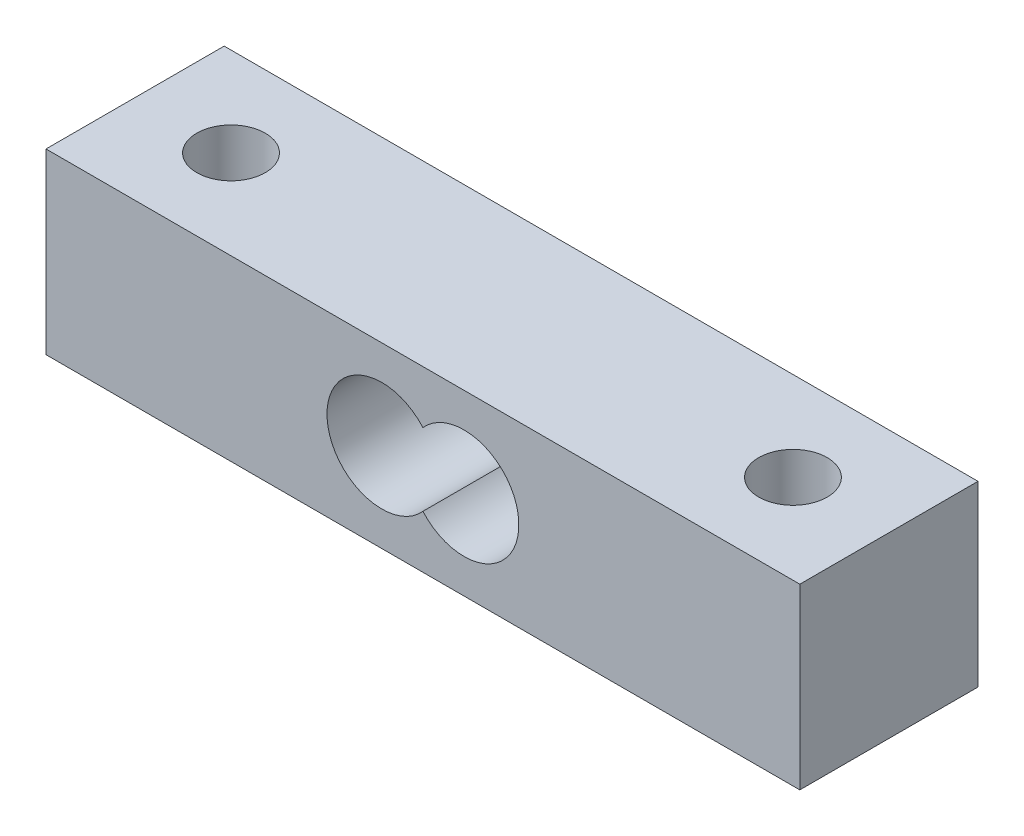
ISO-10303-21;
HEADER;
FILE_DESCRIPTION(('STEP AP214'),'2;1');
FILE_NAME('part.step','',(''),(''),'','','');
FILE_SCHEMA(('AUTOMOTIVE_DESIGN { 1 0 10303 214 1 1 1 1 }'));
ENDSEC;
DATA;
#1=APPLICATION_CONTEXT('core data for automotive mechanical design processes');
#2=APPLICATION_PROTOCOL_DEFINITION('international standard','automotive_design',2000,#1);
#3=PRODUCT_CONTEXT('',#1,'mechanical');
#4=PRODUCT('Part','Part','',(#3));
#5=PRODUCT_RELATED_PRODUCT_CATEGORY('part','',(#4));
#6=PRODUCT_DEFINITION_FORMATION('','',#4);
#7=PRODUCT_DEFINITION_CONTEXT('part definition',#1,'design');
#8=PRODUCT_DEFINITION('design','',#6,#7);
#9=PRODUCT_DEFINITION_SHAPE('','',#8);
#10=(LENGTH_UNIT() NAMED_UNIT(*) SI_UNIT(.MILLI.,.METRE.));
#11=(NAMED_UNIT(*) PLANE_ANGLE_UNIT() SI_UNIT($,.RADIAN.));
#12=(NAMED_UNIT(*) SI_UNIT($,.STERADIAN.) SOLID_ANGLE_UNIT());
#13=UNCERTAINTY_MEASURE_WITH_UNIT(LENGTH_MEASURE(1.E-05),#10,'distance_accuracy_value','');
#14=(GEOMETRIC_REPRESENTATION_CONTEXT(3) GLOBAL_UNCERTAINTY_ASSIGNED_CONTEXT((#13)) GLOBAL_UNIT_ASSIGNED_CONTEXT((#10,
#11,#12)) REPRESENTATION_CONTEXT('',''));
#15=CARTESIAN_POINT('',(0.,0.,0.));
#16=DIRECTION('',(0.,0.,1.));
#17=DIRECTION('',(1.,0.,0.));
#18=AXIS2_PLACEMENT_3D('',#15,#16,#17);
#19=CARTESIAN_POINT('',(0.,0.,13.));
#20=DIRECTION('',(0.,0.,1.));
#21=DIRECTION('',(1.,0.,0.));
#22=AXIS2_PLACEMENT_3D('',#19,#20,#21);
#23=PLANE('',#22);
#24=DIRECTION('',(0.,-1.,0.));
#25=VECTOR('',#24,1.);
#26=CARTESIAN_POINT('',(-27.5,6.5,13.));
#27=LINE('',#26,#25);
#28=CARTESIAN_POINT('',(-27.5,6.5,13.));
#29=VERTEX_POINT('',#28);
#30=CARTESIAN_POINT('',(-27.5,-6.5,13.));
#31=VERTEX_POINT('',#30);
#32=EDGE_CURVE('E106',#29,#31,#27,.T.);
#33=ORIENTED_EDGE('',*,*,#32,.T.);
#34=DIRECTION('',(1.,0.,0.));
#35=VECTOR('',#34,1.);
#36=CARTESIAN_POINT('',(-27.5,-6.5,13.));
#37=LINE('',#36,#35);
#38=CARTESIAN_POINT('',(27.5,-6.5,13.));
#39=VERTEX_POINT('',#38);
#40=EDGE_CURVE('E109',#31,#39,#37,.T.);
#41=ORIENTED_EDGE('',*,*,#40,.T.);
#42=DIRECTION('',(0.,1.,0.));
#43=VECTOR('',#42,1.);
#44=CARTESIAN_POINT('',(27.5,6.5,13.));
#45=LINE('',#44,#43);
#46=CARTESIAN_POINT('',(27.5,6.5,13.));
#47=VERTEX_POINT('',#46);
#48=EDGE_CURVE('E112',#39,#47,#45,.T.);
#49=ORIENTED_EDGE('',*,*,#48,.T.);
#50=DIRECTION('',(-1.,0.,0.));
#51=VECTOR('',#50,1.);
#52=CARTESIAN_POINT('',(-27.5,6.5,13.));
#53=LINE('',#52,#51);
#54=EDGE_CURVE('E114',#47,#29,#53,.T.);
#55=ORIENTED_EDGE('',*,*,#54,.T.);
#56=EDGE_LOOP('',(#33,#41,#49,#55));
#57=FACE_BOUND('',#56,.T.);
#58=CARTESIAN_POINT('',(-3.,0.,13.));
#59=DIRECTION('',(0.,0.,1.));
#60=DIRECTION('',(1.,0.,0.));
#61=AXIS2_PLACEMENT_3D('',#58,#59,#60);
#62=CIRCLE('',#61,4.);
#63=CARTESIAN_POINT('',(0.,2.64575131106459,13.));
#64=VERTEX_POINT('',#63);
#65=CARTESIAN_POINT('',(0.,-2.64575131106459,13.));
#66=VERTEX_POINT('',#65);
#67=EDGE_CURVE('E85',#64,#66,#62,.T.);
#68=ORIENTED_EDGE('',*,*,#67,.F.);
#69=CARTESIAN_POINT('',(3.,0.,13.));
#70=DIRECTION('',(0.,0.,1.));
#71=DIRECTION('',(1.,0.,0.));
#72=AXIS2_PLACEMENT_3D('',#69,#70,#71);
#73=CIRCLE('',#72,4.);
#74=EDGE_CURVE('E91',#66,#64,#73,.T.);
#75=ORIENTED_EDGE('',*,*,#74,.F.);
#76=EDGE_LOOP('',(#68,#75));
#77=FACE_BOUND('',#76,.T.);
#78=ADVANCED_FACE('F33',(#57,#77),#23,.T.);
#79=CARTESIAN_POINT('',(0.,0.,0.));
#80=DIRECTION('',(0.,0.,1.));
#81=DIRECTION('',(1.,0.,0.));
#82=AXIS2_PLACEMENT_3D('',#79,#80,#81);
#83=PLANE('',#82);
#84=DIRECTION('',(0.,-1.,0.));
#85=VECTOR('',#84,1.);
#86=CARTESIAN_POINT('',(-27.5,6.5,0.));
#87=LINE('',#86,#85);
#88=CARTESIAN_POINT('',(-27.5,6.5,0.));
#89=VERTEX_POINT('',#88);
#90=CARTESIAN_POINT('',(-27.5,-6.5,0.));
#91=VERTEX_POINT('',#90);
#92=EDGE_CURVE('E105',#89,#91,#87,.T.);
#93=ORIENTED_EDGE('',*,*,#92,.F.);
#94=DIRECTION('',(-1.,0.,0.));
#95=VECTOR('',#94,1.);
#96=CARTESIAN_POINT('',(-27.5,6.5,0.));
#97=LINE('',#96,#95);
#98=CARTESIAN_POINT('',(27.5,6.5,0.));
#99=VERTEX_POINT('',#98);
#100=EDGE_CURVE('E110',#99,#89,#97,.T.);
#101=ORIENTED_EDGE('',*,*,#100,.F.);
#102=DIRECTION('',(0.,1.,0.));
#103=VECTOR('',#102,1.);
#104=CARTESIAN_POINT('',(27.5,6.5,0.));
#105=LINE('',#104,#103);
#106=CARTESIAN_POINT('',(27.5,-6.5,0.));
#107=VERTEX_POINT('',#106);
#108=EDGE_CURVE('E121',#107,#99,#105,.T.);
#109=ORIENTED_EDGE('',*,*,#108,.F.);
#110=DIRECTION('',(1.,0.,0.));
#111=VECTOR('',#110,1.);
#112=CARTESIAN_POINT('',(-27.5,-6.5,0.));
#113=LINE('',#112,#111);
#114=EDGE_CURVE('E119',#91,#107,#113,.T.);
#115=ORIENTED_EDGE('',*,*,#114,.F.);
#116=EDGE_LOOP('',(#93,#101,#109,#115));
#117=FACE_BOUND('',#116,.T.);
#118=CARTESIAN_POINT('',(3.,0.,0.));
#119=DIRECTION('',(0.,0.,1.));
#120=DIRECTION('',(1.,0.,0.));
#121=AXIS2_PLACEMENT_3D('',#118,#119,#120);
#122=CIRCLE('',#121,4.);
#123=CARTESIAN_POINT('',(0.,-2.64575131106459,0.));
#124=VERTEX_POINT('',#123);
#125=CARTESIAN_POINT('',(0.,2.64575131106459,0.));
#126=VERTEX_POINT('',#125);
#127=EDGE_CURVE('E55',#124,#126,#122,.T.);
#128=ORIENTED_EDGE('',*,*,#127,.T.);
#129=CARTESIAN_POINT('',(-3.,0.,0.));
#130=DIRECTION('',(0.,0.,1.));
#131=DIRECTION('',(1.,0.,0.));
#132=AXIS2_PLACEMENT_3D('',#129,#130,#131);
#133=CIRCLE('',#132,4.);
#134=EDGE_CURVE('E95',#126,#124,#133,.T.);
#135=ORIENTED_EDGE('',*,*,#134,.T.);
#136=EDGE_LOOP('',(#128,#135));
#137=FACE_BOUND('',#136,.T.);
#138=ADVANCED_FACE('F139',(#117,#137),#83,.F.);
#139=CARTESIAN_POINT('',(-27.5,6.5,13.));
#140=DIRECTION('',(1.,0.,0.));
#141=DIRECTION('',(0.,0.,-1.));
#142=AXIS2_PLACEMENT_3D('',#139,#140,#141);
#143=PLANE('',#142);
#144=ORIENTED_EDGE('',*,*,#92,.T.);
#145=DIRECTION('',(0.,0.,-1.));
#146=VECTOR('',#145,1.);
#147=CARTESIAN_POINT('',(-27.5,-6.5,13.));
#148=LINE('',#147,#146);
#149=EDGE_CURVE('E11',#31,#91,#148,.T.);
#150=ORIENTED_EDGE('',*,*,#149,.F.);
#151=ORIENTED_EDGE('',*,*,#32,.F.);
#152=DIRECTION('',(0.,0.,-1.));
#153=VECTOR('',#152,1.);
#154=CARTESIAN_POINT('',(-27.5,6.5,13.));
#155=LINE('',#154,#153);
#156=EDGE_CURVE('E116',#29,#89,#155,.T.);
#157=ORIENTED_EDGE('',*,*,#156,.T.);
#158=EDGE_LOOP('',(#144,#150,#151,#157));
#159=FACE_BOUND('',#158,.T.);
#160=ADVANCED_FACE('F35',(#159),#143,.F.);
#161=CARTESIAN_POINT('',(-27.5,-6.5,13.));
#162=DIRECTION('',(0.,1.,0.));
#163=DIRECTION('',(0.,0.,1.));
#164=AXIS2_PLACEMENT_3D('',#161,#162,#163);
#165=PLANE('',#164);
#166=CARTESIAN_POINT('',(-20.5,-6.5,6.5));
#167=DIRECTION('',(0.,1.,0.));
#168=DIRECTION('',(0.,0.,1.));
#169=AXIS2_PLACEMENT_3D('',#166,#167,#168);
#170=CIRCLE('',#169,2.5);
#171=CARTESIAN_POINT('',(-20.5,-6.5,9.));
#172=VERTEX_POINT('',#171);
#173=EDGE_CURVE('E102',#172,#172,#170,.T.);
#174=ORIENTED_EDGE('',*,*,#173,.T.);
#175=EDGE_LOOP('',(#174));
#176=FACE_BOUND('',#175,.T.);
#177=CARTESIAN_POINT('',(20.5,-6.5,6.5));
#178=DIRECTION('',(0.,1.,0.));
#179=DIRECTION('',(0.,0.,1.));
#180=AXIS2_PLACEMENT_3D('',#177,#178,#179);
#181=CIRCLE('',#180,2.5);
#182=CARTESIAN_POINT('',(20.5,-6.5,9.));
#183=VERTEX_POINT('',#182);
#184=EDGE_CURVE('E180',#183,#183,#181,.T.);
#185=ORIENTED_EDGE('',*,*,#184,.T.);
#186=EDGE_LOOP('',(#185));
#187=FACE_BOUND('',#186,.T.);
#188=ORIENTED_EDGE('',*,*,#114,.T.);
#189=DIRECTION('',(0.,0.,-1.));
#190=VECTOR('',#189,1.);
#191=CARTESIAN_POINT('',(27.5,-6.5,13.));
#192=LINE('',#191,#190);
#193=EDGE_CURVE('E41',#39,#107,#192,.T.);
#194=ORIENTED_EDGE('',*,*,#193,.F.);
#195=ORIENTED_EDGE('',*,*,#40,.F.);
#196=ORIENTED_EDGE('',*,*,#149,.T.);
#197=EDGE_LOOP('',(#188,#194,#195,#196));
#198=FACE_BOUND('',#197,.T.);
#199=ADVANCED_FACE('F149',(#176,#187,#198),#165,.F.);
#200=CARTESIAN_POINT('',(27.5,6.5,13.));
#201=DIRECTION('',(-1.,0.,0.));
#202=DIRECTION('',(0.,0.,1.));
#203=AXIS2_PLACEMENT_3D('',#200,#201,#202);
#204=PLANE('',#203);
#205=ORIENTED_EDGE('',*,*,#108,.T.);
#206=DIRECTION('',(0.,0.,-1.));
#207=VECTOR('',#206,1.);
#208=CARTESIAN_POINT('',(27.5,6.5,13.));
#209=LINE('',#208,#207);
#210=EDGE_CURVE('E126',#47,#99,#209,.T.);
#211=ORIENTED_EDGE('',*,*,#210,.F.);
#212=ORIENTED_EDGE('',*,*,#48,.F.);
#213=ORIENTED_EDGE('',*,*,#193,.T.);
#214=EDGE_LOOP('',(#205,#211,#212,#213));
#215=FACE_BOUND('',#214,.T.);
#216=ADVANCED_FACE('F133',(#215),#204,.F.);
#217=CARTESIAN_POINT('',(-27.5,6.5,13.));
#218=DIRECTION('',(0.,-1.,0.));
#219=DIRECTION('',(0.,0.,-1.));
#220=AXIS2_PLACEMENT_3D('',#217,#218,#219);
#221=PLANE('',#220);
#222=CARTESIAN_POINT('',(-20.5,6.5,6.5));
#223=DIRECTION('',(0.,1.,0.));
#224=DIRECTION('',(0.,0.,1.));
#225=AXIS2_PLACEMENT_3D('',#222,#223,#224);
#226=CIRCLE('',#225,2.5);
#227=CARTESIAN_POINT('',(-20.5,6.5,9.));
#228=VERTEX_POINT('',#227);
#229=EDGE_CURVE('E176',#228,#228,#226,.T.);
#230=ORIENTED_EDGE('',*,*,#229,.F.);
#231=EDGE_LOOP('',(#230));
#232=FACE_BOUND('',#231,.T.);
#233=CARTESIAN_POINT('',(20.5,6.5,6.5));
#234=DIRECTION('',(0.,1.,0.));
#235=DIRECTION('',(0.,0.,1.));
#236=AXIS2_PLACEMENT_3D('',#233,#234,#235);
#237=CIRCLE('',#236,2.5);
#238=CARTESIAN_POINT('',(20.5,6.5,9.));
#239=VERTEX_POINT('',#238);
#240=EDGE_CURVE('E99',#239,#239,#237,.T.);
#241=ORIENTED_EDGE('',*,*,#240,.F.);
#242=EDGE_LOOP('',(#241));
#243=FACE_BOUND('',#242,.T.);
#244=ORIENTED_EDGE('',*,*,#100,.T.);
#245=ORIENTED_EDGE('',*,*,#156,.F.);
#246=ORIENTED_EDGE('',*,*,#54,.F.);
#247=ORIENTED_EDGE('',*,*,#210,.T.);
#248=EDGE_LOOP('',(#244,#245,#246,#247));
#249=FACE_BOUND('',#248,.T.);
#250=ADVANCED_FACE('F143',(#232,#243,#249),#221,.F.);
#251=CARTESIAN_POINT('',(3.,0.,13.));
#252=DIRECTION('',(0.,0.,-1.));
#253=DIRECTION('',(-1.,0.,0.));
#254=AXIS2_PLACEMENT_3D('',#251,#252,#253);
#255=CYLINDRICAL_SURFACE('',#254,4.);
#256=ORIENTED_EDGE('',*,*,#127,.F.);
#257=DIRECTION('',(0.,0.,-1.));
#258=VECTOR('',#257,1.);
#259=CARTESIAN_POINT('',(0.,-2.64575131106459,13.));
#260=LINE('',#259,#258);
#261=EDGE_CURVE('E87',#66,#124,#260,.T.);
#262=ORIENTED_EDGE('',*,*,#261,.F.);
#263=ORIENTED_EDGE('',*,*,#74,.T.);
#264=DIRECTION('',(0.,0.,-1.));
#265=VECTOR('',#264,1.);
#266=CARTESIAN_POINT('',(0.,2.64575131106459,13.));
#267=LINE('',#266,#265);
#268=EDGE_CURVE('E48',#64,#126,#267,.T.);
#269=ORIENTED_EDGE('',*,*,#268,.T.);
#270=EDGE_LOOP('',(#256,#262,#263,#269));
#271=FACE_BOUND('',#270,.T.);
#272=ADVANCED_FACE('F93',(#271),#255,.F.);
#273=CARTESIAN_POINT('',(-3.,0.,13.));
#274=DIRECTION('',(0.,0.,-1.));
#275=DIRECTION('',(-1.,0.,0.));
#276=AXIS2_PLACEMENT_3D('',#273,#274,#275);
#277=CYLINDRICAL_SURFACE('',#276,4.);
#278=ORIENTED_EDGE('',*,*,#134,.F.);
#279=ORIENTED_EDGE('',*,*,#268,.F.);
#280=ORIENTED_EDGE('',*,*,#67,.T.);
#281=ORIENTED_EDGE('',*,*,#261,.T.);
#282=EDGE_LOOP('',(#278,#279,#280,#281));
#283=FACE_BOUND('',#282,.T.);
#284=ADVANCED_FACE('F86',(#283),#277,.F.);
#285=CARTESIAN_POINT('',(20.5,-6.5,6.5));
#286=DIRECTION('',(0.,1.,0.));
#287=DIRECTION('',(0.,0.,1.));
#288=AXIS2_PLACEMENT_3D('',#285,#286,#287);
#289=CYLINDRICAL_SURFACE('',#288,2.5);
#290=CARTESIAN_POINT('',(20.5,-6.5,9.));
#291=CARTESIAN_POINT('',(20.5,-6.36458333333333,9.));
#292=CARTESIAN_POINT('',(20.5,-6.22916666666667,9.));
#293=CARTESIAN_POINT('',(20.5,-5.95833333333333,9.));
#294=CARTESIAN_POINT('',(20.5,-5.82291666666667,9.));
#295=CARTESIAN_POINT('',(20.5,-5.55208333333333,9.));
#296=CARTESIAN_POINT('',(20.5,-5.41666666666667,9.));
#297=CARTESIAN_POINT('',(20.5,-5.14583333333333,9.));
#298=CARTESIAN_POINT('',(20.5,-5.01041666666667,9.));
#299=CARTESIAN_POINT('',(20.5,-4.73958333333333,9.));
#300=CARTESIAN_POINT('',(20.5,-4.60416666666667,9.));
#301=CARTESIAN_POINT('',(20.5,-4.33333333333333,9.));
#302=CARTESIAN_POINT('',(20.5,-4.19791666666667,9.));
#303=CARTESIAN_POINT('',(20.5,-3.92708333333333,9.));
#304=CARTESIAN_POINT('',(20.5,-3.79166666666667,9.));
#305=CARTESIAN_POINT('',(20.5,-3.52083333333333,9.));
#306=CARTESIAN_POINT('',(20.5,-3.38541666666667,9.));
#307=CARTESIAN_POINT('',(20.5,-3.11458333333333,9.));
#308=CARTESIAN_POINT('',(20.5,-2.97916666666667,9.));
#309=CARTESIAN_POINT('',(20.5,-2.70833333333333,9.));
#310=CARTESIAN_POINT('',(20.5,-2.57291666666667,9.));
#311=CARTESIAN_POINT('',(20.5,-2.30208333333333,9.));
#312=CARTESIAN_POINT('',(20.5,-2.16666666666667,9.));
#313=CARTESIAN_POINT('',(20.5,-1.89583333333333,9.));
#314=CARTESIAN_POINT('',(20.5,-1.76041666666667,9.));
#315=CARTESIAN_POINT('',(20.5,-1.48958333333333,9.));
#316=CARTESIAN_POINT('',(20.5,-1.35416666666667,9.));
#317=CARTESIAN_POINT('',(20.5,-1.08333333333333,9.));
#318=CARTESIAN_POINT('',(20.5,-0.947916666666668,9.));
#319=CARTESIAN_POINT('',(20.5,-0.677083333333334,9.));
#320=CARTESIAN_POINT('',(20.5,-0.541666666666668,9.));
#321=CARTESIAN_POINT('',(20.5,-0.270833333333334,9.));
#322=CARTESIAN_POINT('',(20.5,-0.135416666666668,9.));
#323=CARTESIAN_POINT('',(20.5,0.135416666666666,9.));
#324=CARTESIAN_POINT('',(20.5,0.270833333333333,9.));
#325=CARTESIAN_POINT('',(20.5,0.541666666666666,9.));
#326=CARTESIAN_POINT('',(20.5,0.677083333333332,9.));
#327=CARTESIAN_POINT('',(20.5,0.947916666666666,9.));
#328=CARTESIAN_POINT('',(20.5,1.08333333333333,9.));
#329=CARTESIAN_POINT('',(20.5,1.35416666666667,9.));
#330=CARTESIAN_POINT('',(20.5,1.48958333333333,9.));
#331=CARTESIAN_POINT('',(20.5,1.76041666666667,9.));
#332=CARTESIAN_POINT('',(20.5,1.89583333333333,9.));
#333=CARTESIAN_POINT('',(20.5,2.16666666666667,9.));
#334=CARTESIAN_POINT('',(20.5,2.30208333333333,9.));
#335=CARTESIAN_POINT('',(20.5,2.57291666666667,9.));
#336=CARTESIAN_POINT('',(20.5,2.70833333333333,9.));
#337=CARTESIAN_POINT('',(20.5,2.97916666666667,9.));
#338=CARTESIAN_POINT('',(20.5,3.11458333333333,9.));
#339=CARTESIAN_POINT('',(20.5,3.38541666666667,9.));
#340=CARTESIAN_POINT('',(20.5,3.52083333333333,9.));
#341=CARTESIAN_POINT('',(20.5,3.79166666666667,9.));
#342=CARTESIAN_POINT('',(20.5,3.92708333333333,9.));
#343=CARTESIAN_POINT('',(20.5,4.19791666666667,9.));
#344=CARTESIAN_POINT('',(20.5,4.33333333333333,9.));
#345=CARTESIAN_POINT('',(20.5,4.60416666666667,9.));
#346=CARTESIAN_POINT('',(20.5,4.73958333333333,9.));
#347=CARTESIAN_POINT('',(20.5,5.01041666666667,9.));
#348=CARTESIAN_POINT('',(20.5,5.14583333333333,9.));
#349=CARTESIAN_POINT('',(20.5,5.41666666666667,9.));
#350=CARTESIAN_POINT('',(20.5,5.55208333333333,9.));
#351=CARTESIAN_POINT('',(20.5,5.82291666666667,9.));
#352=CARTESIAN_POINT('',(20.5,5.95833333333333,9.));
#353=CARTESIAN_POINT('',(20.5,6.22916666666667,9.));
#354=CARTESIAN_POINT('',(20.5,6.36458333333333,9.));
#355=CARTESIAN_POINT('',(20.5,6.5,9.));
#356=B_SPLINE_CURVE_WITH_KNOTS('',3,(#290,#291,#292,#293,#294,#295,#296,#297,#298,#299,#300,
#301,#302,#303,#304,#305,#306,#307,#308,#309,#310,#311,#312,#313,#314,#315,#316,#317,#318,#319,
#320,#321,#322,#323,#324,#325,#326,#327,#328,#329,#330,#331,#332,#333,#334,#335,#336,#337,#338,
#339,#340,#341,#342,#343,#344,#345,#346,#347,#348,#349,#350,#351,#352,#353,#354,#355),
.UNSPECIFIED.,.F.,.F.,(4,2,2,2,2,2,2,2,2,2,2,2,2,2,2,2,2,2,2,2,2,2,2,2,2,2,2,2,2,2,2,2,4),(0.,
0.40625,0.812500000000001,1.21875,1.625,2.03125,2.4375,2.84375,3.25,3.65625,4.0625,4.46875,
4.875,5.28125,5.6875,6.09375,6.5,6.90625,7.3125,7.71875,8.125,8.53125,8.9375,9.34375,9.75,
10.15625,10.5625,10.96875,11.375,11.78125,12.1875,12.59375,13.),.UNSPECIFIED.);
#357=EDGE_CURVE('BSEAM190',#183,#239,#356,.T.);
#358=ORIENTED_EDGE('',*,*,#184,.F.);
#359=ORIENTED_EDGE('',*,*,#240,.T.);
#360=ORIENTED_EDGE('',*,*,#357,.T.);
#361=ORIENTED_EDGE('',*,*,#357,.F.);
#362=EDGE_LOOP('',(#358,#360,#359,#361));
#363=FACE_BOUND('',#362,.T.);
#364=ADVANCED_FACE('F190',(#363),#289,.F.);
#365=CARTESIAN_POINT('',(-20.5,-6.5,6.5));
#366=DIRECTION('',(0.,1.,0.));
#367=DIRECTION('',(0.,0.,1.));
#368=AXIS2_PLACEMENT_3D('',#365,#366,#367);
#369=CYLINDRICAL_SURFACE('',#368,2.5);
#370=CARTESIAN_POINT('',(-20.5,-6.5,9.));
#371=CARTESIAN_POINT('',(-20.5,-6.36458333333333,9.));
#372=CARTESIAN_POINT('',(-20.5,-6.22916666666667,9.));
#373=CARTESIAN_POINT('',(-20.5,-5.95833333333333,9.));
#374=CARTESIAN_POINT('',(-20.5,-5.82291666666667,9.));
#375=CARTESIAN_POINT('',(-20.5,-5.55208333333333,9.));
#376=CARTESIAN_POINT('',(-20.5,-5.41666666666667,9.));
#377=CARTESIAN_POINT('',(-20.5,-5.14583333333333,9.));
#378=CARTESIAN_POINT('',(-20.5,-5.01041666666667,9.));
#379=CARTESIAN_POINT('',(-20.5,-4.73958333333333,9.));
#380=CARTESIAN_POINT('',(-20.5,-4.60416666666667,9.));
#381=CARTESIAN_POINT('',(-20.5,-4.33333333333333,9.));
#382=CARTESIAN_POINT('',(-20.5,-4.19791666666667,9.));
#383=CARTESIAN_POINT('',(-20.5,-3.92708333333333,9.));
#384=CARTESIAN_POINT('',(-20.5,-3.79166666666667,9.));
#385=CARTESIAN_POINT('',(-20.5,-3.52083333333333,9.));
#386=CARTESIAN_POINT('',(-20.5,-3.38541666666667,9.));
#387=CARTESIAN_POINT('',(-20.5,-3.11458333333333,9.));
#388=CARTESIAN_POINT('',(-20.5,-2.97916666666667,9.));
#389=CARTESIAN_POINT('',(-20.5,-2.70833333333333,9.));
#390=CARTESIAN_POINT('',(-20.5,-2.57291666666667,9.));
#391=CARTESIAN_POINT('',(-20.5,-2.30208333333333,9.));
#392=CARTESIAN_POINT('',(-20.5,-2.16666666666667,9.));
#393=CARTESIAN_POINT('',(-20.5,-1.89583333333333,9.));
#394=CARTESIAN_POINT('',(-20.5,-1.76041666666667,9.));
#395=CARTESIAN_POINT('',(-20.5,-1.48958333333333,9.));
#396=CARTESIAN_POINT('',(-20.5,-1.35416666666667,9.));
#397=CARTESIAN_POINT('',(-20.5,-1.08333333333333,9.));
#398=CARTESIAN_POINT('',(-20.5,-0.947916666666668,9.));
#399=CARTESIAN_POINT('',(-20.5,-0.677083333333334,9.));
#400=CARTESIAN_POINT('',(-20.5,-0.541666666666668,9.));
#401=CARTESIAN_POINT('',(-20.5,-0.270833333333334,9.));
#402=CARTESIAN_POINT('',(-20.5,-0.135416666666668,9.));
#403=CARTESIAN_POINT('',(-20.5,0.135416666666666,9.));
#404=CARTESIAN_POINT('',(-20.5,0.270833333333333,9.));
#405=CARTESIAN_POINT('',(-20.5,0.541666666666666,9.));
#406=CARTESIAN_POINT('',(-20.5,0.677083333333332,9.));
#407=CARTESIAN_POINT('',(-20.5,0.947916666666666,9.));
#408=CARTESIAN_POINT('',(-20.5,1.08333333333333,9.));
#409=CARTESIAN_POINT('',(-20.5,1.35416666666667,9.));
#410=CARTESIAN_POINT('',(-20.5,1.48958333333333,9.));
#411=CARTESIAN_POINT('',(-20.5,1.76041666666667,9.));
#412=CARTESIAN_POINT('',(-20.5,1.89583333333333,9.));
#413=CARTESIAN_POINT('',(-20.5,2.16666666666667,9.));
#414=CARTESIAN_POINT('',(-20.5,2.30208333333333,9.));
#415=CARTESIAN_POINT('',(-20.5,2.57291666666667,9.));
#416=CARTESIAN_POINT('',(-20.5,2.70833333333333,9.));
#417=CARTESIAN_POINT('',(-20.5,2.97916666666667,9.));
#418=CARTESIAN_POINT('',(-20.5,3.11458333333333,9.));
#419=CARTESIAN_POINT('',(-20.5,3.38541666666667,9.));
#420=CARTESIAN_POINT('',(-20.5,3.52083333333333,9.));
#421=CARTESIAN_POINT('',(-20.5,3.79166666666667,9.));
#422=CARTESIAN_POINT('',(-20.5,3.92708333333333,9.));
#423=CARTESIAN_POINT('',(-20.5,4.19791666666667,9.));
#424=CARTESIAN_POINT('',(-20.5,4.33333333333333,9.));
#425=CARTESIAN_POINT('',(-20.5,4.60416666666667,9.));
#426=CARTESIAN_POINT('',(-20.5,4.73958333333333,9.));
#427=CARTESIAN_POINT('',(-20.5,5.01041666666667,9.));
#428=CARTESIAN_POINT('',(-20.5,5.14583333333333,9.));
#429=CARTESIAN_POINT('',(-20.5,5.41666666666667,9.));
#430=CARTESIAN_POINT('',(-20.5,5.55208333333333,9.));
#431=CARTESIAN_POINT('',(-20.5,5.82291666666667,9.));
#432=CARTESIAN_POINT('',(-20.5,5.95833333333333,9.));
#433=CARTESIAN_POINT('',(-20.5,6.22916666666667,9.));
#434=CARTESIAN_POINT('',(-20.5,6.36458333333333,9.));
#435=CARTESIAN_POINT('',(-20.5,6.5,9.));
#436=B_SPLINE_CURVE_WITH_KNOTS('',3,(#370,#371,#372,#373,#374,#375,#376,#377,#378,#379,#380,
#381,#382,#383,#384,#385,#386,#387,#388,#389,#390,#391,#392,#393,#394,#395,#396,#397,#398,#399,
#400,#401,#402,#403,#404,#405,#406,#407,#408,#409,#410,#411,#412,#413,#414,#415,#416,#417,#418,
#419,#420,#421,#422,#423,#424,#425,#426,#427,#428,#429,#430,#431,#432,#433,#434,#435),
.UNSPECIFIED.,.F.,.F.,(4,2,2,2,2,2,2,2,2,2,2,2,2,2,2,2,2,2,2,2,2,2,2,2,2,2,2,2,2,2,2,2,4),(0.,
0.40625,0.812500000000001,1.21875,1.625,2.03125,2.4375,2.84375,3.25,3.65625,4.0625,4.46875,
4.875,5.28125,5.6875,6.09375,6.5,6.90625,7.3125,7.71875,8.125,8.53125,8.9375,9.34375,9.75,
10.15625,10.5625,10.96875,11.375,11.78125,12.1875,12.59375,13.),.UNSPECIFIED.);
#437=EDGE_CURVE('BSEAM187',#172,#228,#436,.T.);
#438=ORIENTED_EDGE('',*,*,#173,.F.);
#439=ORIENTED_EDGE('',*,*,#229,.T.);
#440=ORIENTED_EDGE('',*,*,#437,.T.);
#441=ORIENTED_EDGE('',*,*,#437,.F.);
#442=EDGE_LOOP('',(#438,#440,#439,#441));
#443=FACE_BOUND('',#442,.T.);
#444=ADVANCED_FACE('F187',(#443),#369,.F.);
#445=CLOSED_SHELL('',(#78,#138,#160,#199,#216,#250,#272,#284,#364,#444));
#446=MANIFOLD_SOLID_BREP('B2',#445);
#447=ADVANCED_BREP_SHAPE_REPRESENTATION('',(#18,#446),#14);
#448=SHAPE_DEFINITION_REPRESENTATION(#9,#447);
ENDSEC;
END-ISO-10303-21;
